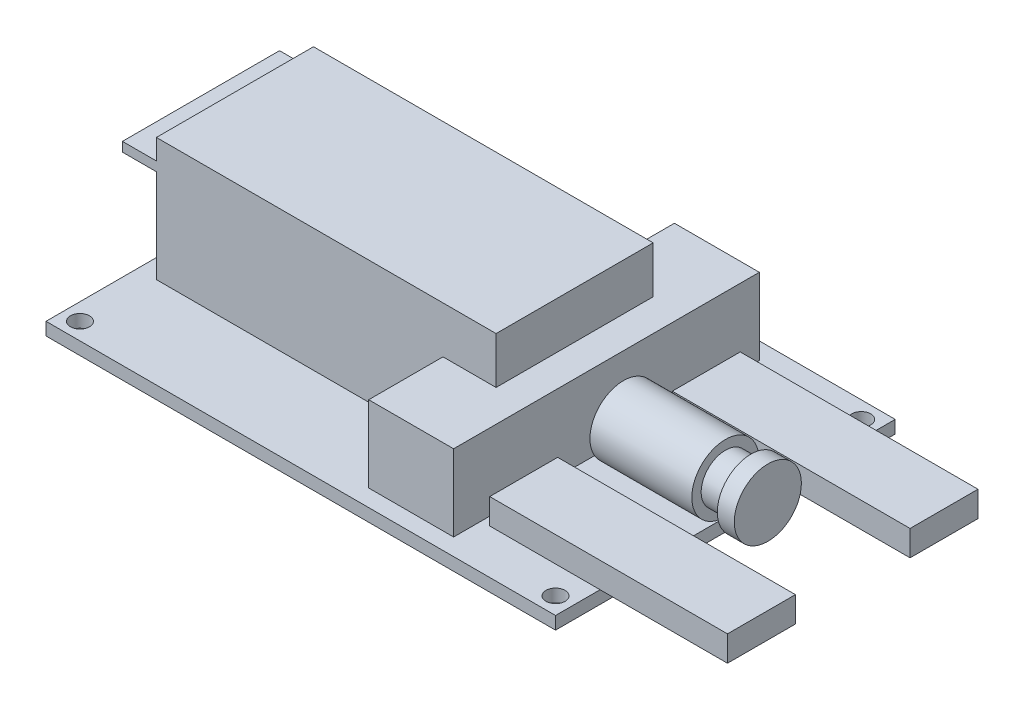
from build123d import *

# Parameters (mm, degrees)
SKETCH1_W                  = 60
SKETCH1_H                  = 40
SKETCH1_R                  = 1.125
BOSS_EXTRUDE1_DEPTH        = 1.5
SKETCH2_R                  = 3.95
BOSS_EXTRUDE2_DEPTH        = 12
SKETCH4_R                  = 2.85
BOSS_EXTRUDE3_DEPTH        = 3
BOSS_EXTRUDE4_START        = 3
SKETCH2_2_R                = 3.95
BOSS_EXTRUDE4_DEPTH        = 2
BOSS_EXTRUDE5_DEPTH        = 15
BOSS_EXTRUDE5_DEPTH_BACK   = 13
SKETCH5_W                  = 8
SKETCH5_H                  = 3
BOSS_EXTRUDE5_2_DEPTH      = 15
BOSS_EXTRUDE5_2_DEPTH_BACK = 13
SKETCH6_W                  = 10
SKETCH6_H                  = 36
BOSS_EXTRUDE6_DEPTH        = 9
SKETCH11_W                 = 44
SKETCH11_H                 = 18.5
BOSS_EXTRUDE11_DEPTH       = 14.5
SKETCH12_W                 = 18.5
SKETCH12_H                 = 11
CUT_EXTRUDE1_DEPTH         = 4
SKETCH13_W                 = 18.5
SKETCH13_H                 = 2.4
CUT_EXTRUDE2_DEPTH         = 4


with BuildPart() as part:
    # Sketch1 → Boss-Extrude1 (new body)
    with BuildSketch(Plane(origin=(0, 0, 0), x_dir=(1, 0, 0), z_dir=(0, 1, 0))):
        Rectangle(SKETCH1_W, SKETCH1_H)
        with Locations(Location((-28, 18, 0), (0, 0, 270))):
            Circle(SKETCH1_R, mode=Mode.SUBTRACT)
        with Locations(Location((28, 18, 0), (0, 0, 90))):
            Circle(SKETCH1_R, mode=Mode.SUBTRACT)
        with Locations(Location((-28, -18, 0), (0, 0, 90))):
            Circle(SKETCH1_R, mode=Mode.SUBTRACT)
        with Locations(Location((28, -18, 0), (0, 0, 270))):
            Circle(SKETCH1_R, mode=Mode.SUBTRACT)
    extrude(amount=-BOSS_EXTRUDE1_DEPTH)

    # Sketch6 → Boss-Extrude6 (add)
    with BuildSketch(Plane(origin=(0, 0, 0), x_dir=(1, 0, 0), z_dir=(0, 1, 0))):
        with Locations((11, 0)):
            Rectangle(SKETCH6_W, SKETCH6_H)
    extrude(amount=BOSS_EXTRUDE6_DEPTH)

    # Sketch11 → Boss-Extrude11 (add)
    with BuildSketch(Plane(origin=(0, 0, 0), x_dir=(1, 0, 0), z_dir=(0, 1, 0))):
        with Locations((-9.75, 0)):
            Rectangle(SKETCH11_W, SKETCH11_H)
    extrude(amount=BOSS_EXTRUDE11_DEPTH)

    # Sketch12 → Cut-Extrude1 (cut)
    with BuildSketch(Plane.ZY.offset(31.75)):
        with Locations((0, 5.5)):
            Rectangle(SKETCH12_W, SKETCH12_H)
    extrude(amount=-CUT_EXTRUDE1_DEPTH, mode=Mode.SUBTRACT)

    # Sketch13 → Cut-Extrude2 (cut)
    with BuildSketch(Plane.ZY.offset(31.75)):
        with Locations((0, 13.3)):
            Rectangle(SKETCH13_W, SKETCH13_H)
    extrude(amount=-CUT_EXTRUDE2_DEPTH, mode=Mode.SUBTRACT)


with BuildPart() as body_2:
    # Sketch2 → Boss-Extrude2 (new body)
    with BuildSketch(Plane(origin=(30, 0, 0), x_dir=(0, 0, -1), z_dir=(1, 0, 0))):
        with Locations((0, 4)):
            Circle(SKETCH2_R)
    extrude(amount=-BOSS_EXTRUDE2_DEPTH)


with BuildPart() as body_3:
    # Sketch4 → Boss-Extrude3 (new body)
    with BuildSketch(Plane(origin=(30, 0, 0), x_dir=(0, 0, -1), z_dir=(1, 0, 0))):
        with Locations((0, 4)):
            Circle(SKETCH4_R)
    extrude(amount=BOSS_EXTRUDE3_DEPTH)


with BuildPart() as body_4:
    # Sketch2_2 → Boss-Extrude4 (new body)
    with BuildSketch(Plane(origin=(30, 0, 0), x_dir=(0, 0, -1), z_dir=(1, 0, 0)).offset(BOSS_EXTRUDE4_START)):
        with Locations((0, 4)):
            Circle(SKETCH2_2_R)
    extrude(amount=BOSS_EXTRUDE4_DEPTH)


with BuildPart() as body_5:
    # Sketch5 → Boss-Extrude5 (new, two sides: drawn at the far end of the back side and taken through both)
    with BuildSketch(Plane(origin=(30, 0, 0), x_dir=(0, 0, -1), z_dir=(1, 0, 0)).offset(-BOSS_EXTRUDE5_DEPTH_BACK)):
        with Locations((-10.75, 1.5)):
            Rectangle(SKETCH5_W, SKETCH5_H)
    extrude(amount=BOSS_EXTRUDE5_DEPTH + BOSS_EXTRUDE5_DEPTH_BACK)


with BuildPart() as body_6:
    # Sketch5 → Boss-Extrude5 2 (new, two sides: drawn at the far end of the back side and taken through both)
    with BuildSketch(Plane(origin=(30, 0, 0), x_dir=(0, 0, -1), z_dir=(1, 0, 0)).offset(-BOSS_EXTRUDE5_2_DEPTH_BACK)):
        with Locations((10.75, 1.5)):
            Rectangle(SKETCH5_W, SKETCH5_H)
    extrude(amount=BOSS_EXTRUDE5_2_DEPTH + BOSS_EXTRUDE5_2_DEPTH_BACK)


solid = Compound([part.part, body_2.part, body_3.part, body_4.part, body_5.part, body_6.part])
